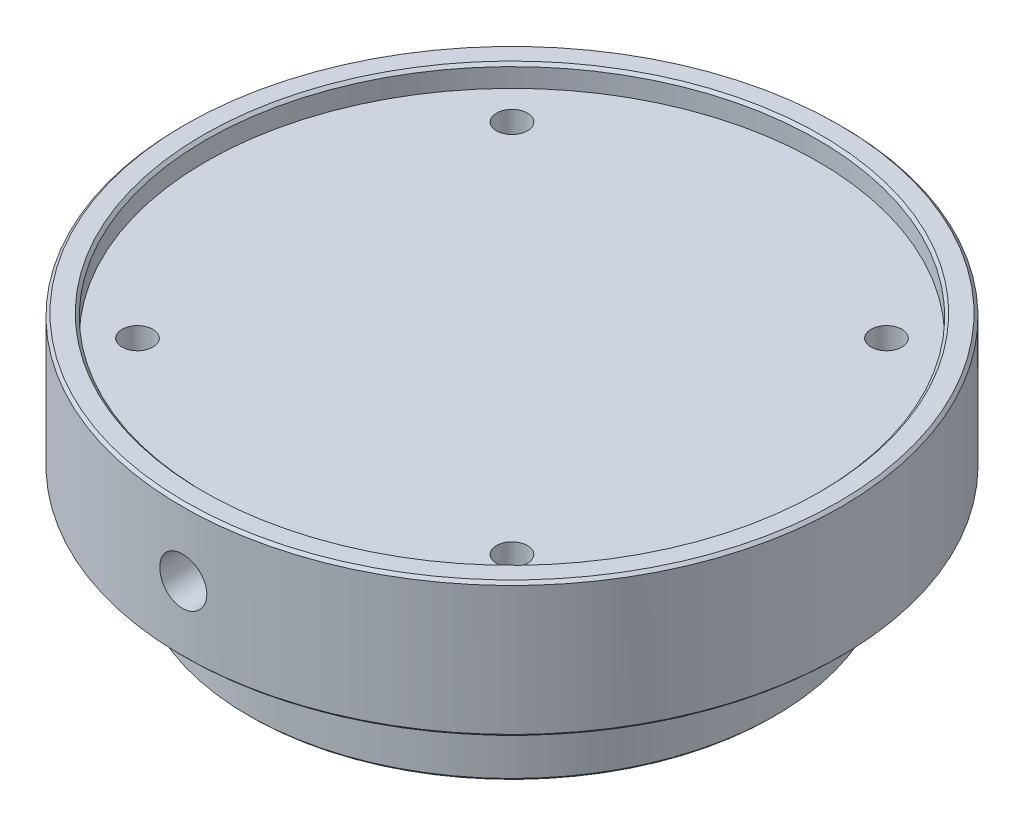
from build123d import *

# Parameters (mm, degrees)
CHAMFER1_SIZE                   = 0.381
F_8_32_TAPPED_HOLE1_D           = 3.4544
F_8_32_TAPPED_HOLE1_DEPTH       = 11.43
F_8_32_TAPPED_HOLE1_CBORE_D     = 4.1656
F_8_32_TAPPED_HOLE1_CBORE_DEPTH = 9.652
F_8_32_TAPPED_HOLE1_TIP         = 1.037806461
CIRPATTERN1_COUNT               = 2


with BuildPart() as part:
    # Sketch1 → Revolve1 (revolve)
    with BuildSketch(Plane.XY, mode=Mode.PRIVATE) as revolve1_sk:
        Polygon((0, -29.591), (0, -2.921), (41.275, -2.921), (41.275, 0), (44.45, 0), (44.45, -18.161), (35.56, -18.161), (35.56, -29.591), align=None)
    revolve(revolve1_sk.sketch.rotate(Axis((0, 0, 0), (0, -1, 0)), 180), axis=Axis((0, 0, 0), (0, -1, 0)))

    # Chamfer1
    chamfer1_edges = [part.edges().sort_by_distance(p)[0] for p in [
        (35.56, -29.591, 0),
        (44.45, -18.161, 0),
        (44.45, 0, 0),
        (41.275, 0, 0),
    ]]
    chamfer(chamfer1_edges, length=CHAMFER1_SIZE)

    # 8-32 Tapped Hole1
    with Locations(Plane(origin=(-25.256970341, -2.921, -25.256970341), x_dir=(1, 0, 0), z_dir=(0, 1, 0))):
        with Locations((0, 0), (0, -50.513940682), (50.513940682, 0), (50.513940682, -50.513940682)):
            CounterBoreHole(F_8_32_TAPPED_HOLE1_D / 2, F_8_32_TAPPED_HOLE1_CBORE_D / 2, F_8_32_TAPPED_HOLE1_CBORE_DEPTH, depth=F_8_32_TAPPED_HOLE1_DEPTH)
            with Locations((0, 0, -(F_8_32_TAPPED_HOLE1_DEPTH + F_8_32_TAPPED_HOLE1_TIP / 2))):  # 118° drill point
                Cone(0, F_8_32_TAPPED_HOLE1_D / 2, F_8_32_TAPPED_HOLE1_TIP, mode=Mode.SUBTRACT)

    # Sketch9 → 1_4-20 Tapped Hole1 (revolve, cut)
    with BuildSketch(Plane(origin=(0, -9.0805, 44.45), x_dir=(0, -1, 0), z_dir=(1, 0, 0))):
        Polygon((0, 0), (0, 18.043816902), (2.5527, 16.51), (2.5527, 12.7), (3.175, 12.7), (3.175, 0), align=None)
    f_1_4_20_tapped_hole1 = revolve(axis=Axis((0, -9.0805, 50.8), (0, 0, -1)), mode=Mode.SUBTRACT)

    # CirPattern1: 1_4-20 Tapped Hole1 ×2 about axis
    cirpattern1_axis = Axis((0, -17.78, 0), (0, 1, 0))
    for i in range(1, CIRPATTERN1_COUNT):
        add(f_1_4_20_tapped_hole1.rotate(cirpattern1_axis, i * 360 / CIRPATTERN1_COUNT), mode=Mode.SUBTRACT)


solid = part.part
